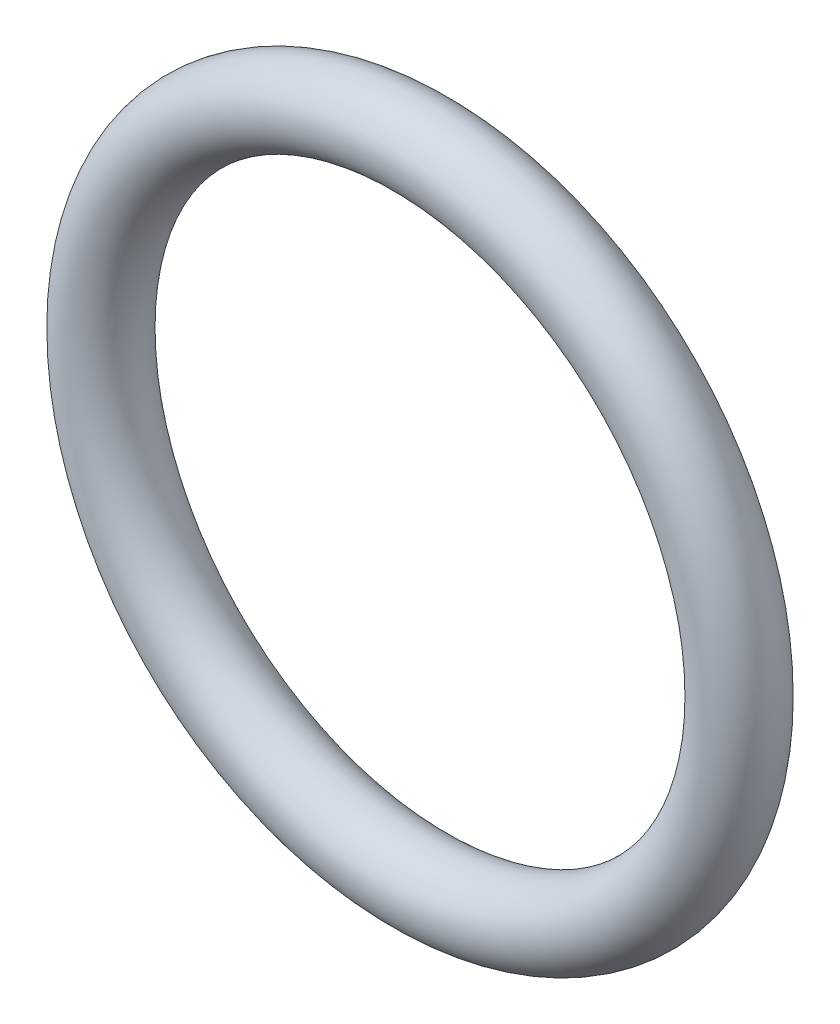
from build123d import *

# Parameters (mm, degrees)
SWEEP_1_PROFILE_R = 1.5


with BuildPart() as part:
    # Sweep 1: sweep along a path in Sketch 1
    with BuildLine(Plane.XY) as sweep_1_path:
        CenterArc((0, 0), 12.5, 0, 360)
    # Sweep 1 profile (on start of the path) → Sweep 1 (sweep)
    with BuildSketch(Plane(origin=(12.5, 0, 0), x_dir=(0, 0, 1), z_dir=(0, 1, 0))):
        Circle(SWEEP_1_PROFILE_R)
    sweep(path=sweep_1_path.line)


solid = part.part
